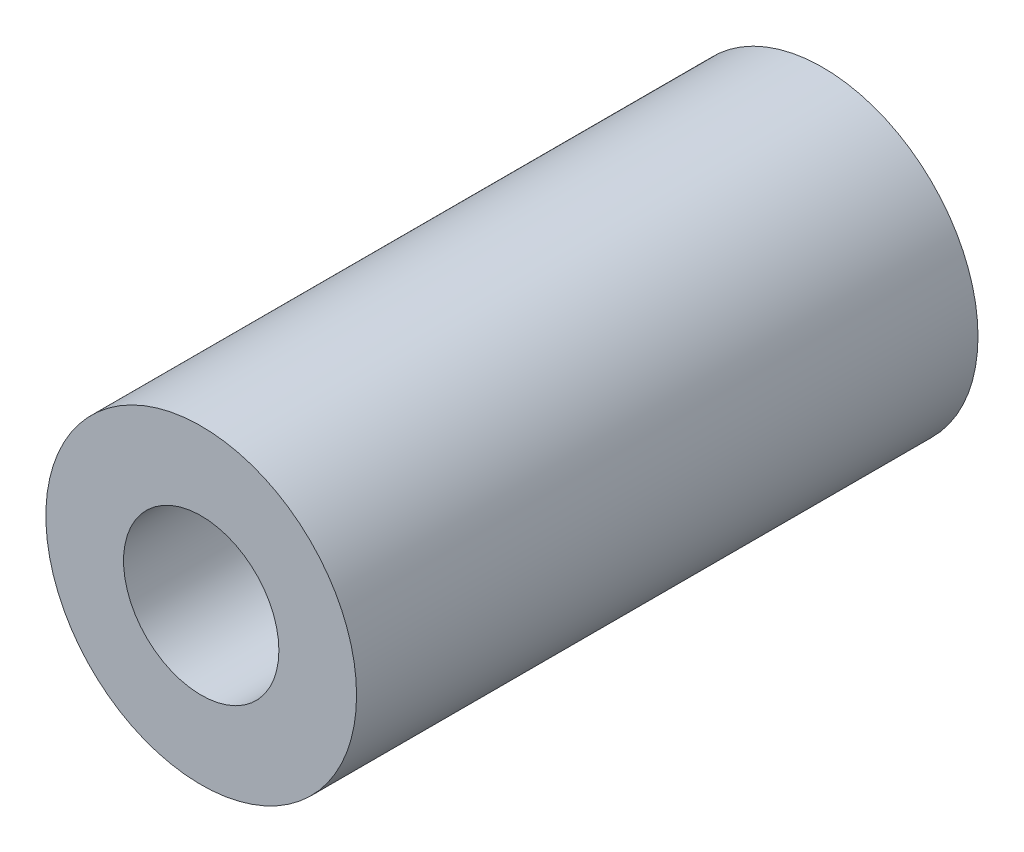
ISO-10303-21;
HEADER;
FILE_DESCRIPTION(('STEP AP214'),'2;1');
FILE_NAME('part.step','',(''),(''),'','','');
FILE_SCHEMA(('AUTOMOTIVE_DESIGN { 1 0 10303 214 1 1 1 1 }'));
ENDSEC;
DATA;
#1=APPLICATION_CONTEXT('core data for automotive mechanical design processes');
#2=APPLICATION_PROTOCOL_DEFINITION('international standard','automotive_design',2000,#1);
#3=PRODUCT_CONTEXT('',#1,'mechanical');
#4=PRODUCT('Part','Part','',(#3));
#5=PRODUCT_RELATED_PRODUCT_CATEGORY('part','',(#4));
#6=PRODUCT_DEFINITION_FORMATION('','',#4);
#7=PRODUCT_DEFINITION_CONTEXT('part definition',#1,'design');
#8=PRODUCT_DEFINITION('design','',#6,#7);
#9=PRODUCT_DEFINITION_SHAPE('','',#8);
#10=(LENGTH_UNIT() NAMED_UNIT(*) SI_UNIT(.MILLI.,.METRE.));
#11=(NAMED_UNIT(*) PLANE_ANGLE_UNIT() SI_UNIT($,.RADIAN.));
#12=(NAMED_UNIT(*) SI_UNIT($,.STERADIAN.) SOLID_ANGLE_UNIT());
#13=UNCERTAINTY_MEASURE_WITH_UNIT(LENGTH_MEASURE(1.E-05),#10,'distance_accuracy_value','');
#14=(GEOMETRIC_REPRESENTATION_CONTEXT(3) GLOBAL_UNCERTAINTY_ASSIGNED_CONTEXT((#13)) GLOBAL_UNIT_ASSIGNED_CONTEXT((#10,
#11,#12)) REPRESENTATION_CONTEXT('',''));
#15=CARTESIAN_POINT('',(0.,0.,0.));
#16=DIRECTION('',(0.,0.,1.));
#17=DIRECTION('',(1.,0.,0.));
#18=AXIS2_PLACEMENT_3D('',#15,#16,#17);
#19=CARTESIAN_POINT('',(0.,0.,32.));
#20=DIRECTION('',(0.,0.,1.));
#21=DIRECTION('',(1.,0.,0.));
#22=AXIS2_PLACEMENT_3D('',#19,#20,#21);
#23=PLANE('',#22);
#24=CARTESIAN_POINT('',(0.,0.,32.));
#25=DIRECTION('',(0.,0.,1.));
#26=DIRECTION('',(1.,0.,0.));
#27=AXIS2_PLACEMENT_3D('',#24,#25,#26);
#28=CIRCLE('',#27,8.);
#29=CARTESIAN_POINT('',(8.,0.,32.));
#30=VERTEX_POINT('',#29);
#31=EDGE_CURVE('E9',#30,#30,#28,.T.);
#32=ORIENTED_EDGE('',*,*,#31,.T.);
#33=EDGE_LOOP('',(#32));
#34=FACE_BOUND('',#33,.T.);
#35=CARTESIAN_POINT('',(0.,0.,32.));
#36=DIRECTION('',(0.,0.,1.));
#37=DIRECTION('',(1.,0.,0.));
#38=AXIS2_PLACEMENT_3D('',#35,#36,#37);
#39=CIRCLE('',#38,4.);
#40=CARTESIAN_POINT('',(4.,0.,32.));
#41=VERTEX_POINT('',#40);
#42=EDGE_CURVE('E25',#41,#41,#39,.T.);
#43=ORIENTED_EDGE('',*,*,#42,.F.);
#44=EDGE_LOOP('',(#43));
#45=FACE_BOUND('',#44,.T.);
#46=ADVANCED_FACE('F14',(#34,#45),#23,.T.);
#47=CARTESIAN_POINT('',(0.,0.,0.));
#48=DIRECTION('',(0.,0.,1.));
#49=DIRECTION('',(1.,0.,0.));
#50=AXIS2_PLACEMENT_3D('',#47,#48,#49);
#51=PLANE('',#50);
#52=CARTESIAN_POINT('',(0.,0.,0.));
#53=DIRECTION('',(0.,0.,1.));
#54=DIRECTION('',(1.,0.,0.));
#55=AXIS2_PLACEMENT_3D('',#52,#53,#54);
#56=CIRCLE('',#55,8.);
#57=CARTESIAN_POINT('',(8.,0.,0.));
#58=VERTEX_POINT('',#57);
#59=EDGE_CURVE('E18',#58,#58,#56,.T.);
#60=ORIENTED_EDGE('',*,*,#59,.F.);
#61=EDGE_LOOP('',(#60));
#62=FACE_BOUND('',#61,.T.);
#63=CARTESIAN_POINT('',(0.,0.,0.));
#64=DIRECTION('',(0.,0.,1.));
#65=DIRECTION('',(1.,0.,0.));
#66=AXIS2_PLACEMENT_3D('',#63,#64,#65);
#67=CIRCLE('',#66,4.);
#68=CARTESIAN_POINT('',(4.,0.,0.));
#69=VERTEX_POINT('',#68);
#70=EDGE_CURVE('E27',#69,#69,#67,.T.);
#71=ORIENTED_EDGE('',*,*,#70,.T.);
#72=EDGE_LOOP('',(#71));
#73=FACE_BOUND('',#72,.T.);
#74=ADVANCED_FACE('F37',(#62,#73),#51,.F.);
#75=CARTESIAN_POINT('',(0.,0.,32.));
#76=DIRECTION('',(0.,0.,-1.));
#77=DIRECTION('',(-1.,0.,0.));
#78=AXIS2_PLACEMENT_3D('',#75,#76,#77);
#79=CYLINDRICAL_SURFACE('',#78,8.);
#80=ORIENTED_EDGE('',*,*,#31,.F.);
#81=EDGE_LOOP('',(#80));
#82=FACE_BOUND('',#81,.T.);
#83=ORIENTED_EDGE('',*,*,#59,.T.);
#84=EDGE_LOOP('',(#83));
#85=FACE_BOUND('',#84,.T.);
#86=ADVANCED_FACE('F16',(#82,#85),#79,.T.);
#87=CARTESIAN_POINT('',(0.,0.,32.));
#88=DIRECTION('',(0.,0.,-1.));
#89=DIRECTION('',(-1.,0.,0.));
#90=AXIS2_PLACEMENT_3D('',#87,#88,#89);
#91=CYLINDRICAL_SURFACE('',#90,4.);
#92=ORIENTED_EDGE('',*,*,#42,.T.);
#93=EDGE_LOOP('',(#92));
#94=FACE_BOUND('',#93,.T.);
#95=ORIENTED_EDGE('',*,*,#70,.F.);
#96=EDGE_LOOP('',(#95));
#97=FACE_BOUND('',#96,.T.);
#98=ADVANCED_FACE('F33',(#94,#97),#91,.F.);
#99=CLOSED_SHELL('',(#46,#74,#86,#98));
#100=MANIFOLD_SOLID_BREP('B1',#99);
#101=ADVANCED_BREP_SHAPE_REPRESENTATION('',(#18,#100),#14);
#102=SHAPE_DEFINITION_REPRESENTATION(#9,#101);
ENDSEC;
END-ISO-10303-21;
